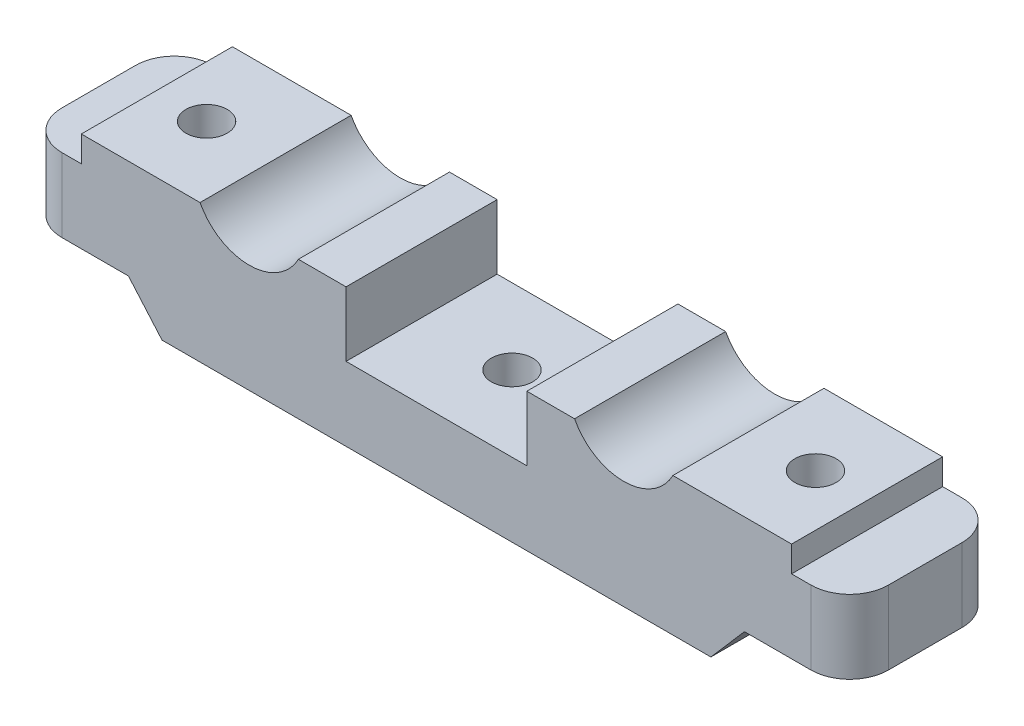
from build123d import *

# Parameters (mm, degrees)
BASE_EXTRUSION_DEPTH    = 11.7
ESQUISSE2_R             = 1.6
ENL_V_MAT_EXTRU_1_DEPTH = 10
ESQUISSE3_R             = 3.7
ENL_V_MAT_EXTRU_2_DEPTH = 6
CONG_1_R                = 3


with BuildPart() as part:
    # Esquisse1 → Base-Extrusion (new body)
    with BuildSketch(Plane.XY):
        with BuildLine():
            Line((-21.25, 0), (21.25, 0))
            Line((21.25, 0), (23.85, 3))
            Line((23.85, 3), (32, 3))
            Line((32, 3), (32, 8.7))
            Line((32, 8.7), (27.5, 8.7))
            Line((27.5, 8.7), (27.5, 10.7))
            Line((27.5, 10.7), (18.306573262, 10.7))
            ThreePointArc((18.306573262, 10.7), (14.5, 8.4), (10.693426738, 10.7))
            Line((10.693426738, 10.7), (7, 10.7))
            Line((7, 10.7), (7, 5.7))
            Line((7, 5.7), (-7, 5.7))
            Line((-7, 5.7), (-7, 10.7))
            Line((-7, 10.7), (-10.693426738, 10.7))
            ThreePointArc((-10.693426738, 10.7), (-14.5, 8.4), (-18.306573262, 10.7))
            Line((-18.306573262, 10.7), (-27.5, 10.7))
            Line((-27.5, 10.7), (-27.5, 8.7))
            Line((-27.5, 8.7), (-32, 8.7))
            Line((-32, 8.7), (-32, 3))
            Line((-32, 3), (-23.85, 3))
            Line((-23.85, 3), (-21.25, 0))
        make_face()
    extrude(amount=BASE_EXTRUSION_DEPTH)

    # Esquisse2 → Enl_v. mat.-Extru.1 (cut, symmetric)
    with BuildSketch(Plane.XZ.offset(-3)):
        with Locations(Location((23.5, 5.85, 0), (0, 0, 282.635625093))):
            Circle(ESQUISSE2_R)
        with Locations((-23.5, 6)):
            Circle(ESQUISSE2_R)
        with Locations((0, 5.85)):
            Circle(ESQUISSE2_R)
    extrude(amount=ENL_V_MAT_EXTRU_1_DEPTH, both=True, mode=Mode.SUBTRACT)

    # Esquisse3 → Enl_v. mat.-Extru.2 (cut)
    with BuildSketch(Plane.XZ):
        with Locations((-23.5, 6)):
            Circle(ESQUISSE3_R)
    extrude(amount=-ENL_V_MAT_EXTRU_2_DEPTH, mode=Mode.SUBTRACT)

    # Cong_1
    cong_1_edges = [part.edges().sort_by_distance(p)[0] for p in [
        (32, 5.85, 0),
        (-32, 5.85, 0),
        (32, 5.85, 11.7),
        (-32, 5.85, 11.7),
    ]]
    fillet(cong_1_edges, radius=CONG_1_R)


solid = part.part
